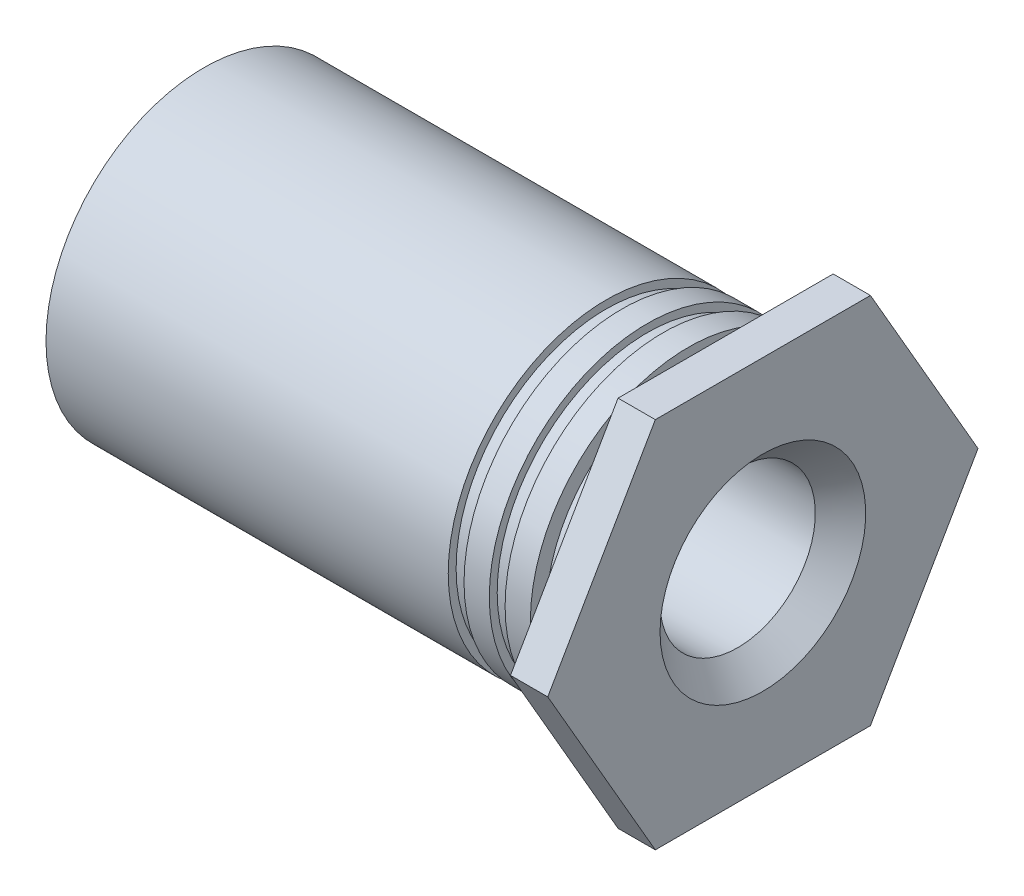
ISO-10303-21;
HEADER;
FILE_DESCRIPTION(('STEP AP214'),'2;1');
FILE_NAME('part.step','',(''),(''),'','','');
FILE_SCHEMA(('AUTOMOTIVE_DESIGN { 1 0 10303 214 1 1 1 1 }'));
ENDSEC;
DATA;
#1=APPLICATION_CONTEXT('core data for automotive mechanical design processes');
#2=APPLICATION_PROTOCOL_DEFINITION('international standard','automotive_design',2000,#1);
#3=PRODUCT_CONTEXT('',#1,'mechanical');
#4=PRODUCT('Part','Part','',(#3));
#5=PRODUCT_RELATED_PRODUCT_CATEGORY('part','',(#4));
#6=PRODUCT_DEFINITION_FORMATION('','',#4);
#7=PRODUCT_DEFINITION_CONTEXT('part definition',#1,'design');
#8=PRODUCT_DEFINITION('design','',#6,#7);
#9=PRODUCT_DEFINITION_SHAPE('','',#8);
#10=(LENGTH_UNIT() NAMED_UNIT(*) SI_UNIT(.MILLI.,.METRE.));
#11=(NAMED_UNIT(*) PLANE_ANGLE_UNIT() SI_UNIT($,.RADIAN.));
#12=(NAMED_UNIT(*) SI_UNIT($,.STERADIAN.) SOLID_ANGLE_UNIT());
#13=UNCERTAINTY_MEASURE_WITH_UNIT(LENGTH_MEASURE(1.E-05),#10,'distance_accuracy_value','');
#14=(GEOMETRIC_REPRESENTATION_CONTEXT(3) GLOBAL_UNCERTAINTY_ASSIGNED_CONTEXT((#13)) GLOBAL_UNIT_ASSIGNED_CONTEXT((#10,
#11,#12)) REPRESENTATION_CONTEXT('',''));
#15=CARTESIAN_POINT('',(0.,0.,0.));
#16=DIRECTION('',(0.,0.,1.));
#17=DIRECTION('',(1.,0.,0.));
#18=AXIS2_PLACEMENT_3D('',#15,#16,#17);
#19=CARTESIAN_POINT('',(-0.3175,0.,0.));
#20=DIRECTION('',(1.,0.,0.));
#21=DIRECTION('',(0.,0.,1.));
#22=AXIS2_PLACEMENT_3D('',#19,#20,#21);
#23=CYLINDRICAL_SURFACE('',#22,2.42316);
#24=CARTESIAN_POINT('',(-0.635,0.,0.));
#25=DIRECTION('',(-1.,0.,0.));
#26=DIRECTION('',(0.,0.,1.));
#27=AXIS2_PLACEMENT_3D('',#24,#25,#26);
#28=CIRCLE('',#27,2.42316);
#29=CARTESIAN_POINT('',(-0.634999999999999,0.,2.42316));
#30=VERTEX_POINT('',#29);
#31=EDGE_CURVE('E39',#30,#30,#28,.F.);
#32=ORIENTED_EDGE('',*,*,#31,.T.);
#33=EDGE_LOOP('',(#32));
#34=FACE_BOUND('',#33,.T.);
#35=CARTESIAN_POINT('',(0.,0.,0.));
#36=DIRECTION('',(-1.,0.,0.));
#37=DIRECTION('',(0.,0.,1.));
#38=AXIS2_PLACEMENT_3D('',#35,#36,#37);
#39=CIRCLE('',#38,2.42316);
#40=CARTESIAN_POINT('',(0.,0.,2.42316));
#41=VERTEX_POINT('',#40);
#42=EDGE_CURVE('E114',#41,#41,#39,.F.);
#43=ORIENTED_EDGE('',*,*,#42,.F.);
#44=EDGE_LOOP('',(#43));
#45=FACE_BOUND('',#44,.T.);
#46=ADVANCED_FACE('F36',(#34,#45),#23,.T.);
#47=CARTESIAN_POINT('',(-0.635,0.,-1.3462));
#48=DIRECTION('',(1.,0.,0.));
#49=DIRECTION('',(0.,0.,1.));
#50=AXIS2_PLACEMENT_3D('',#47,#48,#49);
#51=PLANE('',#50);
#52=CARTESIAN_POINT('',(-0.635000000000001,0.,0.));
#53=DIRECTION('',(-1.,0.,0.));
#54=DIRECTION('',(0.,0.,1.));
#55=AXIS2_PLACEMENT_3D('',#52,#53,#54);
#56=CIRCLE('',#55,2.6924);
#57=CARTESIAN_POINT('',(-0.635,0.,2.6924));
#58=VERTEX_POINT('',#57);
#59=EDGE_CURVE('E111',#58,#58,#56,.F.);
#60=ORIENTED_EDGE('',*,*,#59,.T.);
#61=EDGE_LOOP('',(#60));
#62=FACE_BOUND('',#61,.T.);
#63=ORIENTED_EDGE('',*,*,#31,.F.);
#64=EDGE_LOOP('',(#63));
#65=FACE_BOUND('',#64,.T.);
#66=ADVANCED_FACE('F162',(#62,#65),#51,.T.);
#67=CARTESIAN_POINT('',(0.,0.,0.));
#68=DIRECTION('',(1.,0.,0.));
#69=DIRECTION('',(0.,1.,0.));
#70=AXIS2_PLACEMENT_3D('',#67,#68,#69);
#71=PLANE('',#70);
#72=ORIENTED_EDGE('',*,*,#42,.T.);
#73=EDGE_LOOP('',(#72));
#74=FACE_BOUND('',#73,.T.);
#75=DIRECTION('',(0.,0.,-1.));
#76=VECTOR('',#75,1.);
#77=CARTESIAN_POINT('',(0.,3.175,-1.83308710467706));
#78=LINE('',#77,#76);
#79=CARTESIAN_POINT('',(0.,3.175,1.83308710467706));
#80=VERTEX_POINT('',#79);
#81=CARTESIAN_POINT('',(0.,3.175,-1.83308710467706));
#82=VERTEX_POINT('',#81);
#83=EDGE_CURVE('E97',#80,#82,#78,.T.);
#84=ORIENTED_EDGE('',*,*,#83,.T.);
#85=DIRECTION('',(0.,-0.866025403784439,-0.5));
#86=VECTOR('',#85,1.);
#87=CARTESIAN_POINT('',(0.,0.,-3.66617420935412));
#88=LINE('',#87,#86);
#89=CARTESIAN_POINT('',(0.,0.,-3.66617420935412));
#90=VERTEX_POINT('',#89);
#91=EDGE_CURVE('E99',#82,#90,#88,.T.);
#92=ORIENTED_EDGE('',*,*,#91,.T.);
#93=DIRECTION('',(0.,-0.866025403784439,0.5));
#94=VECTOR('',#93,1.);
#95=CARTESIAN_POINT('',(0.,-3.175,-1.83308710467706));
#96=LINE('',#95,#94);
#97=CARTESIAN_POINT('',(0.,-3.175,-1.83308710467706));
#98=VERTEX_POINT('',#97);
#99=EDGE_CURVE('E297',#90,#98,#96,.T.);
#100=ORIENTED_EDGE('',*,*,#99,.T.);
#101=DIRECTION('',(0.,0.,1.));
#102=VECTOR('',#101,1.);
#103=CARTESIAN_POINT('',(0.,-3.175,1.83308710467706));
#104=LINE('',#103,#102);
#105=CARTESIAN_POINT('',(0.,-3.175,1.83308710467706));
#106=VERTEX_POINT('',#105);
#107=EDGE_CURVE('E292',#98,#106,#104,.T.);
#108=ORIENTED_EDGE('',*,*,#107,.T.);
#109=DIRECTION('',(0.,0.866025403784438,0.5));
#110=VECTOR('',#109,1.);
#111=CARTESIAN_POINT('',(0.,0.,3.66617420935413));
#112=LINE('',#111,#110);
#113=CARTESIAN_POINT('',(0.,0.,3.66617420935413));
#114=VERTEX_POINT('',#113);
#115=EDGE_CURVE('E288',#106,#114,#112,.T.);
#116=ORIENTED_EDGE('',*,*,#115,.T.);
#117=DIRECTION('',(0.,0.866025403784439,-0.5));
#118=VECTOR('',#117,1.);
#119=CARTESIAN_POINT('',(0.,3.175,1.83308710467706));
#120=LINE('',#119,#118);
#121=EDGE_CURVE('E110',#114,#80,#120,.T.);
#122=ORIENTED_EDGE('',*,*,#121,.T.);
#123=EDGE_LOOP('',(#84,#92,#100,#108,#116,#122));
#124=FACE_BOUND('',#123,.T.);
#125=ADVANCED_FACE('F107',(#74,#124),#71,.F.);
#126=CARTESIAN_POINT('',(-4.7625,0.,0.));
#127=DIRECTION('',(1.,0.,0.));
#128=DIRECTION('',(0.,0.,1.));
#129=AXIS2_PLACEMENT_3D('',#126,#127,#128);
#130=CYLINDRICAL_SURFACE('',#129,2.6924);
#131=CARTESIAN_POINT('',(-1.065784,0.,0.));
#132=DIRECTION('',(-1.,0.,0.));
#133=DIRECTION('',(0.,0.,1.));
#134=AXIS2_PLACEMENT_3D('',#131,#132,#133);
#135=CIRCLE('',#134,2.6924);
#136=CARTESIAN_POINT('',(-1.065784,0.,2.6924));
#137=VERTEX_POINT('',#136);
#138=EDGE_CURVE('E151',#137,#137,#135,.T.);
#139=ORIENTED_EDGE('',*,*,#138,.F.);
#140=EDGE_LOOP('',(#139));
#141=FACE_BOUND('',#140,.T.);
#142=ORIENTED_EDGE('',*,*,#59,.F.);
#143=EDGE_LOOP('',(#142));
#144=FACE_BOUND('',#143,.T.);
#145=ADVANCED_FACE('F169',(#141,#144),#130,.T.);
#146=CARTESIAN_POINT('',(0.,3.175,-1.83308710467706));
#147=DIRECTION('',(0.,1.,0.));
#148=DIRECTION('',(0.,0.,-1.));
#149=AXIS2_PLACEMENT_3D('',#146,#147,#148);
#150=PLANE('',#149);
#151=ORIENTED_EDGE('',*,*,#83,.F.);
#152=DIRECTION('',(1.,0.,0.));
#153=VECTOR('',#152,1.);
#154=CARTESIAN_POINT('',(0.,3.175,1.83308710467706));
#155=LINE('',#154,#153);
#156=CARTESIAN_POINT('',(0.635,3.175,1.83308710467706));
#157=VERTEX_POINT('',#156);
#158=EDGE_CURVE('E153',#80,#157,#155,.T.);
#159=ORIENTED_EDGE('',*,*,#158,.T.);
#160=DIRECTION('',(0.,0.,-1.));
#161=VECTOR('',#160,1.);
#162=CARTESIAN_POINT('',(0.635,3.175,0.));
#163=LINE('',#162,#161);
#164=CARTESIAN_POINT('',(0.635,3.175,-1.83308710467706));
#165=VERTEX_POINT('',#164);
#166=EDGE_CURVE('E98',#157,#165,#163,.T.);
#167=ORIENTED_EDGE('',*,*,#166,.T.);
#168=DIRECTION('',(1.,0.,0.));
#169=VECTOR('',#168,1.);
#170=CARTESIAN_POINT('',(0.,3.175,-1.83308710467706));
#171=LINE('',#170,#169);
#172=EDGE_CURVE('E93',#165,#82,#171,.F.);
#173=ORIENTED_EDGE('',*,*,#172,.T.);
#174=EDGE_LOOP('',(#151,#159,#167,#173));
#175=FACE_BOUND('',#174,.T.);
#176=ADVANCED_FACE('F94',(#175),#150,.T.);
#177=CARTESIAN_POINT('',(0.,0.,-3.66617420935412));
#178=DIRECTION('',(0.,0.5,-0.866025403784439));
#179=DIRECTION('',(0.,-0.866025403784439,-0.5));
#180=AXIS2_PLACEMENT_3D('',#177,#178,#179);
#181=PLANE('',#180);
#182=ORIENTED_EDGE('',*,*,#91,.F.);
#183=ORIENTED_EDGE('',*,*,#172,.F.);
#184=DIRECTION('',(0.,-0.866025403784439,-0.5));
#185=VECTOR('',#184,1.);
#186=CARTESIAN_POINT('',(0.635,3.175,-1.83308710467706));
#187=LINE('',#186,#185);
#188=CARTESIAN_POINT('',(0.635,0.,-3.66617420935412));
#189=VERTEX_POINT('',#188);
#190=EDGE_CURVE('E281',#165,#189,#187,.T.);
#191=ORIENTED_EDGE('',*,*,#190,.T.);
#192=DIRECTION('',(1.,0.,0.));
#193=VECTOR('',#192,1.);
#194=CARTESIAN_POINT('',(0.,0.,-3.66617420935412));
#195=LINE('',#194,#193);
#196=EDGE_CURVE('E86',#189,#90,#195,.F.);
#197=ORIENTED_EDGE('',*,*,#196,.T.);
#198=EDGE_LOOP('',(#182,#183,#191,#197));
#199=FACE_BOUND('',#198,.T.);
#200=ADVANCED_FACE('F102',(#199),#181,.T.);
#201=CARTESIAN_POINT('',(0.,-3.175,-1.83308710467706));
#202=DIRECTION('',(0.,-0.5,-0.866025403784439));
#203=DIRECTION('',(0.,-0.866025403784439,0.5));
#204=AXIS2_PLACEMENT_3D('',#201,#202,#203);
#205=PLANE('',#204);
#206=ORIENTED_EDGE('',*,*,#99,.F.);
#207=ORIENTED_EDGE('',*,*,#196,.F.);
#208=DIRECTION('',(0.,-0.866025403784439,0.5));
#209=VECTOR('',#208,1.);
#210=CARTESIAN_POINT('',(0.635,0.,-3.66617420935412));
#211=LINE('',#210,#209);
#212=CARTESIAN_POINT('',(0.635,-3.175,-1.83308710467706));
#213=VERTEX_POINT('',#212);
#214=EDGE_CURVE('E278',#189,#213,#211,.T.);
#215=ORIENTED_EDGE('',*,*,#214,.T.);
#216=DIRECTION('',(1.,0.,0.));
#217=VECTOR('',#216,1.);
#218=CARTESIAN_POINT('',(0.,-3.175,-1.83308710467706));
#219=LINE('',#218,#217);
#220=EDGE_CURVE('E295',#213,#98,#219,.F.);
#221=ORIENTED_EDGE('',*,*,#220,.T.);
#222=EDGE_LOOP('',(#206,#207,#215,#221));
#223=FACE_BOUND('',#222,.T.);
#224=ADVANCED_FACE('F179',(#223),#205,.T.);
#225=CARTESIAN_POINT('',(0.,-3.175,1.83308710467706));
#226=DIRECTION('',(0.,-1.,0.));
#227=DIRECTION('',(0.,0.,1.));
#228=AXIS2_PLACEMENT_3D('',#225,#226,#227);
#229=PLANE('',#228);
#230=ORIENTED_EDGE('',*,*,#107,.F.);
#231=ORIENTED_EDGE('',*,*,#220,.F.);
#232=DIRECTION('',(0.,0.,-1.));
#233=VECTOR('',#232,1.);
#234=CARTESIAN_POINT('',(0.635,-3.175,0.));
#235=LINE('',#234,#233);
#236=CARTESIAN_POINT('',(0.635,-3.175,1.83308710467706));
#237=VERTEX_POINT('',#236);
#238=EDGE_CURVE('E275',#213,#237,#235,.F.);
#239=ORIENTED_EDGE('',*,*,#238,.T.);
#240=DIRECTION('',(1.,0.,0.));
#241=VECTOR('',#240,1.);
#242=CARTESIAN_POINT('',(0.,-3.175,1.83308710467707));
#243=LINE('',#242,#241);
#244=EDGE_CURVE('E290',#237,#106,#243,.F.);
#245=ORIENTED_EDGE('',*,*,#244,.T.);
#246=EDGE_LOOP('',(#230,#231,#239,#245));
#247=FACE_BOUND('',#246,.T.);
#248=ADVANCED_FACE('F182',(#247),#229,.T.);
#249=CARTESIAN_POINT('',(0.,0.,3.66617420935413));
#250=DIRECTION('',(0.,-0.5,0.866025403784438));
#251=DIRECTION('',(0.,0.866025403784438,0.5));
#252=AXIS2_PLACEMENT_3D('',#249,#250,#251);
#253=PLANE('',#252);
#254=ORIENTED_EDGE('',*,*,#115,.F.);
#255=ORIENTED_EDGE('',*,*,#244,.F.);
#256=DIRECTION('',(0.,0.866025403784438,0.500000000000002));
#257=VECTOR('',#256,1.);
#258=CARTESIAN_POINT('',(0.635,-3.175,1.83308710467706));
#259=LINE('',#258,#257);
#260=CARTESIAN_POINT('',(0.635,0.,3.66617420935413));
#261=VERTEX_POINT('',#260);
#262=EDGE_CURVE('E272',#237,#261,#259,.T.);
#263=ORIENTED_EDGE('',*,*,#262,.T.);
#264=DIRECTION('',(1.,0.,0.));
#265=VECTOR('',#264,1.);
#266=CARTESIAN_POINT('',(0.,0.,3.66617420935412));
#267=LINE('',#266,#265);
#268=EDGE_CURVE('E286',#261,#114,#267,.F.);
#269=ORIENTED_EDGE('',*,*,#268,.T.);
#270=EDGE_LOOP('',(#254,#255,#263,#269));
#271=FACE_BOUND('',#270,.T.);
#272=ADVANCED_FACE('F186',(#271),#253,.T.);
#273=CARTESIAN_POINT('',(0.,3.175,1.83308710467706));
#274=DIRECTION('',(0.,0.5,0.866025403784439));
#275=DIRECTION('',(0.,0.866025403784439,-0.5));
#276=AXIS2_PLACEMENT_3D('',#273,#274,#275);
#277=PLANE('',#276);
#278=ORIENTED_EDGE('',*,*,#121,.F.);
#279=ORIENTED_EDGE('',*,*,#268,.F.);
#280=DIRECTION('',(0.,0.866025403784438,-0.500000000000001));
#281=VECTOR('',#280,1.);
#282=CARTESIAN_POINT('',(0.635,0.,3.66617420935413));
#283=LINE('',#282,#281);
#284=EDGE_CURVE('E54',#261,#157,#283,.T.);
#285=ORIENTED_EDGE('',*,*,#284,.T.);
#286=ORIENTED_EDGE('',*,*,#158,.F.);
#287=EDGE_LOOP('',(#278,#279,#285,#286));
#288=FACE_BOUND('',#287,.T.);
#289=ADVANCED_FACE('F190',(#288),#277,.T.);
#290=CARTESIAN_POINT('',(-1.065784,0.,-2.62509));
#291=DIRECTION('',(1.,0.,0.));
#292=DIRECTION('',(0.,0.,1.));
#293=AXIS2_PLACEMENT_3D('',#290,#291,#292);
#294=PLANE('',#293);
#295=ORIENTED_EDGE('',*,*,#138,.T.);
#296=EDGE_LOOP('',(#295));
#297=FACE_BOUND('',#296,.T.);
#298=CARTESIAN_POINT('',(-1.065784,0.,0.));
#299=DIRECTION('',(-1.,0.,0.));
#300=DIRECTION('',(0.,0.,1.));
#301=AXIS2_PLACEMENT_3D('',#298,#299,#300);
#302=CIRCLE('',#301,2.55778);
#303=CARTESIAN_POINT('',(-1.065784,0.,2.55778));
#304=VERTEX_POINT('',#303);
#305=EDGE_CURVE('E148',#304,#304,#302,.F.);
#306=ORIENTED_EDGE('',*,*,#305,.T.);
#307=EDGE_LOOP('',(#306));
#308=FACE_BOUND('',#307,.T.);
#309=ADVANCED_FACE('F194',(#297,#308),#294,.F.);
#310=CARTESIAN_POINT('',(0.635,0.,0.));
#311=DIRECTION('',(1.,0.,0.));
#312=DIRECTION('',(0.,1.,0.));
#313=AXIS2_PLACEMENT_3D('',#310,#311,#312);
#314=PLANE('',#313);
#315=ORIENTED_EDGE('',*,*,#262,.F.);
#316=ORIENTED_EDGE('',*,*,#238,.F.);
#317=ORIENTED_EDGE('',*,*,#214,.F.);
#318=ORIENTED_EDGE('',*,*,#190,.F.);
#319=ORIENTED_EDGE('',*,*,#166,.F.);
#320=ORIENTED_EDGE('',*,*,#284,.F.);
#321=EDGE_LOOP('',(#315,#316,#317,#318,#319,#320));
#322=FACE_BOUND('',#321,.T.);
#323=CARTESIAN_POINT('',(0.634999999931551,0.,0.));
#324=DIRECTION('',(-1.,0.,0.));
#325=DIRECTION('',(0.,0.,1.));
#326=AXIS2_PLACEMENT_3D('',#323,#324,#325);
#327=CIRCLE('',#326,1.75259999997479);
#328=CARTESIAN_POINT('',(0.634999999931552,0.,1.75259999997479));
#329=VERTEX_POINT('',#328);
#330=EDGE_CURVE('E145',#329,#329,#327,.F.);
#331=ORIENTED_EDGE('',*,*,#330,.F.);
#332=EDGE_LOOP('',(#331));
#333=FACE_BOUND('',#332,.T.);
#334=ADVANCED_FACE('F198',(#322,#333),#314,.T.);
#335=CARTESIAN_POINT('',(-1.200404,0.,0.));
#336=DIRECTION('',(1.,0.,0.));
#337=DIRECTION('',(0.,0.,1.));
#338=AXIS2_PLACEMENT_3D('',#335,#336,#337);
#339=CYLINDRICAL_SURFACE('',#338,2.55778);
#340=CARTESIAN_POINT('',(-1.335024,0.,0.));
#341=DIRECTION('',(-1.,0.,0.));
#342=DIRECTION('',(0.,0.,1.));
#343=AXIS2_PLACEMENT_3D('',#340,#341,#342);
#344=CIRCLE('',#343,2.55778);
#345=CARTESIAN_POINT('',(-1.335024,0.,2.55778));
#346=VERTEX_POINT('',#345);
#347=EDGE_CURVE('E142',#346,#346,#344,.T.);
#348=ORIENTED_EDGE('',*,*,#347,.F.);
#349=EDGE_LOOP('',(#348));
#350=FACE_BOUND('',#349,.T.);
#351=ORIENTED_EDGE('',*,*,#305,.F.);
#352=EDGE_LOOP('',(#351));
#353=FACE_BOUND('',#352,.T.);
#354=ADVANCED_FACE('F202',(#350,#353),#339,.T.);
#355=CARTESIAN_POINT('',(0.634999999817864,0.,0.));
#356=DIRECTION('',(1.,0.,0.));
#357=DIRECTION('',(0.,0.,1.));
#358=AXIS2_PLACEMENT_3D('',#355,#356,#357);
#359=CONICAL_SURFACE('',#358,1.7525999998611,0.785398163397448);
#360=CARTESIAN_POINT('',(0.205739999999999,0.,0.));
#361=DIRECTION('',(-1.,0.,0.));
#362=DIRECTION('',(0.,0.,1.));
#363=AXIS2_PLACEMENT_3D('',#360,#361,#362);
#364=CIRCLE('',#363,1.32334);
#365=CARTESIAN_POINT('',(0.20574,0.,1.32334));
#366=VERTEX_POINT('',#365);
#367=EDGE_CURVE('E141',#366,#366,#364,.F.);
#368=ORIENTED_EDGE('',*,*,#367,.F.);
#369=EDGE_LOOP('',(#368));
#370=FACE_BOUND('',#369,.T.);
#371=ORIENTED_EDGE('',*,*,#330,.T.);
#372=EDGE_LOOP('',(#371));
#373=FACE_BOUND('',#372,.T.);
#374=ADVANCED_FACE('F205',(#370,#373),#359,.F.);
#375=CARTESIAN_POINT('',(-1.335024,0.,-2.62509));
#376=DIRECTION('',(-1.,0.,0.));
#377=DIRECTION('',(0.,0.,-1.));
#378=AXIS2_PLACEMENT_3D('',#375,#376,#377);
#379=PLANE('',#378);
#380=ORIENTED_EDGE('',*,*,#347,.T.);
#381=EDGE_LOOP('',(#380));
#382=FACE_BOUND('',#381,.T.);
#383=CARTESIAN_POINT('',(-1.335024,0.,0.));
#384=DIRECTION('',(-1.,0.,0.));
#385=DIRECTION('',(0.,0.,1.));
#386=AXIS2_PLACEMENT_3D('',#383,#384,#385);
#387=CIRCLE('',#386,2.6924);
#388=CARTESIAN_POINT('',(-1.335024,0.,2.6924));
#389=VERTEX_POINT('',#388);
#390=EDGE_CURVE('E138',#389,#389,#387,.F.);
#391=ORIENTED_EDGE('',*,*,#390,.T.);
#392=EDGE_LOOP('',(#391));
#393=FACE_BOUND('',#392,.T.);
#394=ADVANCED_FACE('F209',(#382,#393),#379,.F.);
#395=CARTESIAN_POINT('',(-1.7526,0.,0.));
#396=DIRECTION('',(1.,0.,0.));
#397=DIRECTION('',(0.,0.,1.));
#398=AXIS2_PLACEMENT_3D('',#395,#396,#397);
#399=CYLINDRICAL_SURFACE('',#398,1.32334);
#400=CARTESIAN_POINT('',(-3.71094000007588,0.,0.));
#401=DIRECTION('',(1.,0.,0.));
#402=DIRECTION('',(0.,0.,1.));
#403=AXIS2_PLACEMENT_3D('',#400,#401,#402);
#404=CIRCLE('',#403,1.32333999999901);
#405=CARTESIAN_POINT('',(-3.71094000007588,0.,1.32333999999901));
#406=VERTEX_POINT('',#405);
#407=EDGE_CURVE('E137',#406,#406,#404,.T.);
#408=ORIENTED_EDGE('',*,*,#407,.F.);
#409=EDGE_LOOP('',(#408));
#410=FACE_BOUND('',#409,.T.);
#411=ORIENTED_EDGE('',*,*,#367,.T.);
#412=EDGE_LOOP('',(#411));
#413=FACE_BOUND('',#412,.T.);
#414=ADVANCED_FACE('F213',(#410,#413),#399,.F.);
#415=CARTESIAN_POINT('',(-4.7625,0.,0.));
#416=DIRECTION('',(1.,0.,0.));
#417=DIRECTION('',(0.,0.,1.));
#418=AXIS2_PLACEMENT_3D('',#415,#416,#417);
#419=CYLINDRICAL_SURFACE('',#418,2.6924);
#420=CARTESIAN_POINT('',(-1.765808,0.,0.));
#421=DIRECTION('',(-1.,0.,0.));
#422=DIRECTION('',(0.,0.,1.));
#423=AXIS2_PLACEMENT_3D('',#420,#421,#422);
#424=CIRCLE('',#423,2.6924);
#425=CARTESIAN_POINT('',(-1.765808,0.,2.6924));
#426=VERTEX_POINT('',#425);
#427=EDGE_CURVE('E134',#426,#426,#424,.T.);
#428=ORIENTED_EDGE('',*,*,#427,.F.);
#429=EDGE_LOOP('',(#428));
#430=FACE_BOUND('',#429,.T.);
#431=ORIENTED_EDGE('',*,*,#390,.F.);
#432=EDGE_LOOP('',(#431));
#433=FACE_BOUND('',#432,.T.);
#434=ADVANCED_FACE('F217',(#430,#433),#419,.T.);
#435=CARTESIAN_POINT('',(-4.14019999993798,0.,0.));
#436=DIRECTION('',(-1.,0.,0.));
#437=DIRECTION('',(0.,0.,-1.));
#438=AXIS2_PLACEMENT_3D('',#435,#436,#437);
#439=CONICAL_SURFACE('',#438,1.7525999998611,0.785398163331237);
#440=CARTESIAN_POINT('',(-4.14019999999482,0.,0.));
#441=DIRECTION('',(1.,0.,0.));
#442=DIRECTION('',(0.,0.,-1.));
#443=AXIS2_PLACEMENT_3D('',#440,#441,#442);
#444=CIRCLE('',#443,1.75259999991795);
#445=CARTESIAN_POINT('',(-4.14019999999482,0.,-1.75259999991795));
#446=VERTEX_POINT('',#445);
#447=EDGE_CURVE('E131',#446,#446,#444,.T.);
#448=ORIENTED_EDGE('',*,*,#447,.F.);
#449=EDGE_LOOP('',(#448));
#450=FACE_BOUND('',#449,.T.);
#451=ORIENTED_EDGE('',*,*,#407,.T.);
#452=EDGE_LOOP('',(#451));
#453=FACE_BOUND('',#452,.T.);
#454=ADVANCED_FACE('F221',(#450,#453),#439,.F.);
#455=CARTESIAN_POINT('',(-1.765808,0.,-2.62509));
#456=DIRECTION('',(1.,0.,0.));
#457=DIRECTION('',(0.,0.,1.));
#458=AXIS2_PLACEMENT_3D('',#455,#456,#457);
#459=PLANE('',#458);
#460=ORIENTED_EDGE('',*,*,#427,.T.);
#461=EDGE_LOOP('',(#460));
#462=FACE_BOUND('',#461,.T.);
#463=CARTESIAN_POINT('',(-1.765808,0.,0.));
#464=DIRECTION('',(-1.,0.,0.));
#465=DIRECTION('',(0.,0.,1.));
#466=AXIS2_PLACEMENT_3D('',#463,#464,#465);
#467=CIRCLE('',#466,2.55778);
#468=CARTESIAN_POINT('',(-1.765808,0.,2.55778));
#469=VERTEX_POINT('',#468);
#470=EDGE_CURVE('E128',#469,#469,#467,.F.);
#471=ORIENTED_EDGE('',*,*,#470,.T.);
#472=EDGE_LOOP('',(#471));
#473=FACE_BOUND('',#472,.T.);
#474=ADVANCED_FACE('F225',(#462,#473),#459,.F.);
#475=CARTESIAN_POINT('',(-4.1402,0.,0.9906));
#476=DIRECTION('',(1.,0.,0.));
#477=DIRECTION('',(0.,0.,1.));
#478=AXIS2_PLACEMENT_3D('',#475,#476,#477);
#479=PLANE('',#478);
#480=CARTESIAN_POINT('',(-4.1402,0.,0.));
#481=DIRECTION('',(1.,0.,0.));
#482=DIRECTION('',(0.,0.,-1.));
#483=AXIS2_PLACEMENT_3D('',#480,#481,#482);
#484=CIRCLE('',#483,1.9812);
#485=CARTESIAN_POINT('',(-4.1402,0.,-1.9812));
#486=VERTEX_POINT('',#485);
#487=EDGE_CURVE('E125',#486,#486,#484,.T.);
#488=ORIENTED_EDGE('',*,*,#487,.F.);
#489=EDGE_LOOP('',(#488));
#490=FACE_BOUND('',#489,.T.);
#491=ORIENTED_EDGE('',*,*,#447,.T.);
#492=EDGE_LOOP('',(#491));
#493=FACE_BOUND('',#492,.T.);
#494=ADVANCED_FACE('F229',(#490,#493),#479,.F.);
#495=CARTESIAN_POINT('',(-1.900428,0.,0.));
#496=DIRECTION('',(1.,0.,0.));
#497=DIRECTION('',(0.,0.,1.));
#498=AXIS2_PLACEMENT_3D('',#495,#496,#497);
#499=CYLINDRICAL_SURFACE('',#498,2.55778);
#500=CARTESIAN_POINT('',(-2.035048,0.,0.));
#501=DIRECTION('',(-1.,0.,0.));
#502=DIRECTION('',(0.,0.,1.));
#503=AXIS2_PLACEMENT_3D('',#500,#501,#502);
#504=CIRCLE('',#503,2.55778);
#505=CARTESIAN_POINT('',(-2.035048,0.,2.55778));
#506=VERTEX_POINT('',#505);
#507=EDGE_CURVE('E122',#506,#506,#504,.T.);
#508=ORIENTED_EDGE('',*,*,#507,.F.);
#509=EDGE_LOOP('',(#508));
#510=FACE_BOUND('',#509,.T.);
#511=ORIENTED_EDGE('',*,*,#470,.F.);
#512=EDGE_LOOP('',(#511));
#513=FACE_BOUND('',#512,.T.);
#514=ADVANCED_FACE('F233',(#510,#513),#499,.T.);
#515=CARTESIAN_POINT('',(-6.5151,0.,0.));
#516=DIRECTION('',(-1.,0.,0.));
#517=DIRECTION('',(0.,0.,-1.));
#518=AXIS2_PLACEMENT_3D('',#515,#516,#517);
#519=CYLINDRICAL_SURFACE('',#518,1.9812);
#520=CARTESIAN_POINT('',(-8.89,0.,0.));
#521=DIRECTION('',(1.,0.,0.));
#522=DIRECTION('',(0.,0.,-1.));
#523=AXIS2_PLACEMENT_3D('',#520,#521,#522);
#524=CIRCLE('',#523,1.9812);
#525=CARTESIAN_POINT('',(-8.89,0.,-1.9812));
#526=VERTEX_POINT('',#525);
#527=EDGE_CURVE('E119',#526,#526,#524,.F.);
#528=ORIENTED_EDGE('',*,*,#527,.T.);
#529=EDGE_LOOP('',(#528));
#530=FACE_BOUND('',#529,.T.);
#531=ORIENTED_EDGE('',*,*,#487,.T.);
#532=EDGE_LOOP('',(#531));
#533=FACE_BOUND('',#532,.T.);
#534=ADVANCED_FACE('F237',(#530,#533),#519,.F.);
#535=CARTESIAN_POINT('',(-2.035048,0.,-2.62509));
#536=DIRECTION('',(-1.,0.,0.));
#537=DIRECTION('',(0.,0.,-1.));
#538=AXIS2_PLACEMENT_3D('',#535,#536,#537);
#539=PLANE('',#538);
#540=ORIENTED_EDGE('',*,*,#507,.T.);
#541=EDGE_LOOP('',(#540));
#542=FACE_BOUND('',#541,.T.);
#543=CARTESIAN_POINT('',(-2.035048,0.,0.));
#544=DIRECTION('',(-1.,0.,0.));
#545=DIRECTION('',(0.,0.,1.));
#546=AXIS2_PLACEMENT_3D('',#543,#544,#545);
#547=CIRCLE('',#546,2.6924);
#548=CARTESIAN_POINT('',(-2.035048,0.,2.6924));
#549=VERTEX_POINT('',#548);
#550=EDGE_CURVE('E45',#549,#549,#547,.F.);
#551=ORIENTED_EDGE('',*,*,#550,.T.);
#552=EDGE_LOOP('',(#551));
#553=FACE_BOUND('',#552,.T.);
#554=ADVANCED_FACE('F241',(#542,#553),#539,.F.);
#555=CARTESIAN_POINT('',(-8.89,0.,-1.3462));
#556=DIRECTION('',(-1.,0.,0.));
#557=DIRECTION('',(0.,0.,-1.));
#558=AXIS2_PLACEMENT_3D('',#555,#556,#557);
#559=PLANE('',#558);
#560=CARTESIAN_POINT('',(-8.89,0.,0.));
#561=DIRECTION('',(-1.,0.,0.));
#562=DIRECTION('',(0.,0.,1.));
#563=AXIS2_PLACEMENT_3D('',#560,#561,#562);
#564=CIRCLE('',#563,2.6924);
#565=CARTESIAN_POINT('',(-8.89,0.,2.6924));
#566=VERTEX_POINT('',#565);
#567=EDGE_CURVE('E11',#566,#566,#564,.T.);
#568=ORIENTED_EDGE('',*,*,#567,.T.);
#569=EDGE_LOOP('',(#568));
#570=FACE_BOUND('',#569,.T.);
#571=ORIENTED_EDGE('',*,*,#527,.F.);
#572=EDGE_LOOP('',(#571));
#573=FACE_BOUND('',#572,.T.);
#574=ADVANCED_FACE('F245',(#570,#573),#559,.T.);
#575=CARTESIAN_POINT('',(-4.7625,0.,0.));
#576=DIRECTION('',(1.,0.,0.));
#577=DIRECTION('',(0.,0.,1.));
#578=AXIS2_PLACEMENT_3D('',#575,#576,#577);
#579=CYLINDRICAL_SURFACE('',#578,2.6924);
#580=ORIENTED_EDGE('',*,*,#550,.F.);
#581=EDGE_LOOP('',(#580));
#582=FACE_BOUND('',#581,.T.);
#583=ORIENTED_EDGE('',*,*,#567,.F.);
#584=EDGE_LOOP('',(#583));
#585=FACE_BOUND('',#584,.T.);
#586=ADVANCED_FACE('F249',(#582,#585),#579,.T.);
#587=CLOSED_SHELL('',(#46,#66,#125,#145,#176,#200,#224,#248,#272,#289,#309,#334,#354,#374,#394,
#414,#434,#454,#474,#494,#514,#534,#554,#574,#586));
#588=MANIFOLD_SOLID_BREP('B2',#587);
#589=ADVANCED_BREP_SHAPE_REPRESENTATION('',(#18,#588),#14);
#590=SHAPE_DEFINITION_REPRESENTATION(#9,#589);
ENDSEC;
END-ISO-10303-21;
